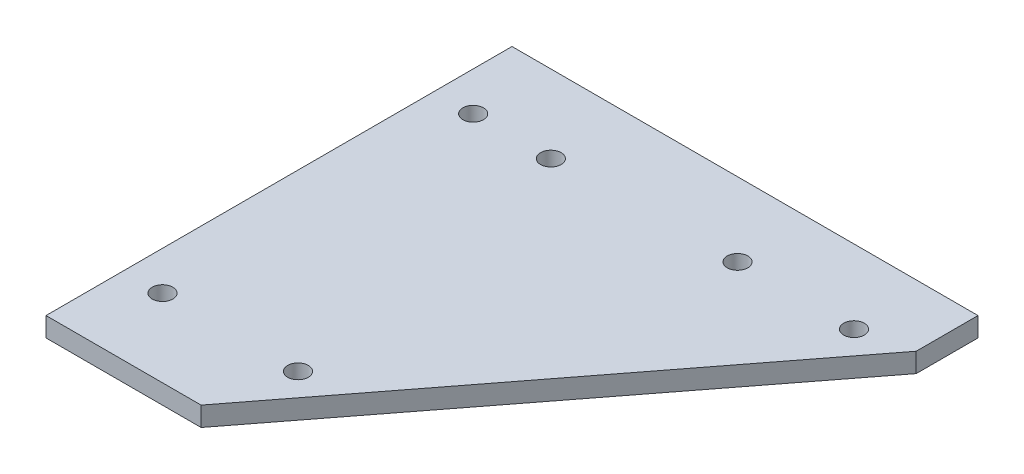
ISO-10303-21;
HEADER;
FILE_DESCRIPTION(('STEP AP214'),'2;1');
FILE_NAME('part.step','',(''),(''),'','','');
FILE_SCHEMA(('AUTOMOTIVE_DESIGN { 1 0 10303 214 1 1 1 1 }'));
ENDSEC;
DATA;
#1=APPLICATION_CONTEXT('core data for automotive mechanical design processes');
#2=APPLICATION_PROTOCOL_DEFINITION('international standard','automotive_design',2000,#1);
#3=PRODUCT_CONTEXT('',#1,'mechanical');
#4=PRODUCT('Part','Part','',(#3));
#5=PRODUCT_RELATED_PRODUCT_CATEGORY('part','',(#4));
#6=PRODUCT_DEFINITION_FORMATION('','',#4);
#7=PRODUCT_DEFINITION_CONTEXT('part definition',#1,'design');
#8=PRODUCT_DEFINITION('design','',#6,#7);
#9=PRODUCT_DEFINITION_SHAPE('','',#8);
#10=(LENGTH_UNIT() NAMED_UNIT(*) SI_UNIT(.MILLI.,.METRE.));
#11=(NAMED_UNIT(*) PLANE_ANGLE_UNIT() SI_UNIT($,.RADIAN.));
#12=(NAMED_UNIT(*) SI_UNIT($,.STERADIAN.) SOLID_ANGLE_UNIT());
#13=UNCERTAINTY_MEASURE_WITH_UNIT(LENGTH_MEASURE(1.E-05),#10,'distance_accuracy_value','');
#14=(GEOMETRIC_REPRESENTATION_CONTEXT(3) GLOBAL_UNCERTAINTY_ASSIGNED_CONTEXT((#13)) GLOBAL_UNIT_ASSIGNED_CONTEXT((#10,
#11,#12)) REPRESENTATION_CONTEXT('',''));
#15=CARTESIAN_POINT('',(0.,0.,0.));
#16=DIRECTION('',(0.,0.,1.));
#17=DIRECTION('',(1.,0.,0.));
#18=AXIS2_PLACEMENT_3D('',#15,#16,#17);
#19=CARTESIAN_POINT('',(0.,6.34999999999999,0.));
#20=DIRECTION('',(1.,0.,0.));
#21=DIRECTION('',(0.,0.,-1.));
#22=AXIS2_PLACEMENT_3D('',#19,#20,#21);
#23=PLANE('',#22);
#24=DIRECTION('',(0.,0.,1.));
#25=VECTOR('',#24,1.);
#26=CARTESIAN_POINT('',(0.,0.,0.));
#27=LINE('',#26,#25);
#28=CARTESIAN_POINT('',(0.,0.,-152.4));
#29=VERTEX_POINT('',#28);
#30=CARTESIAN_POINT('',(0.,0.,0.));
#31=VERTEX_POINT('',#30);
#32=EDGE_CURVE('E105',#29,#31,#27,.T.);
#33=ORIENTED_EDGE('',*,*,#32,.T.);
#34=DIRECTION('',(0.,-1.,0.));
#35=VECTOR('',#34,1.);
#36=CARTESIAN_POINT('',(0.,6.34999999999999,0.));
#37=LINE('',#36,#35);
#38=CARTESIAN_POINT('',(0.,6.34999999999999,0.));
#39=VERTEX_POINT('',#38);
#40=EDGE_CURVE('E11',#39,#31,#37,.T.);
#41=ORIENTED_EDGE('',*,*,#40,.F.);
#42=DIRECTION('',(0.,0.,1.));
#43=VECTOR('',#42,1.);
#44=CARTESIAN_POINT('',(0.,6.34999999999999,0.));
#45=LINE('',#44,#43);
#46=CARTESIAN_POINT('',(0.,6.34999999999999,-152.4));
#47=VERTEX_POINT('',#46);
#48=EDGE_CURVE('E96',#47,#39,#45,.T.);
#49=ORIENTED_EDGE('',*,*,#48,.F.);
#50=DIRECTION('',(0.,-1.,0.));
#51=VECTOR('',#50,1.);
#52=CARTESIAN_POINT('',(0.,6.34999999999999,-152.4));
#53=LINE('',#52,#51);
#54=EDGE_CURVE('E104',#47,#29,#53,.T.);
#55=ORIENTED_EDGE('',*,*,#54,.T.);
#56=EDGE_LOOP('',(#33,#41,#49,#55));
#57=FACE_BOUND('',#56,.T.);
#58=ADVANCED_FACE('F30',(#57),#23,.F.);
#59=CARTESIAN_POINT('',(0.,6.34999999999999,0.));
#60=DIRECTION('',(0.,0.,-1.));
#61=DIRECTION('',(-1.,0.,0.));
#62=AXIS2_PLACEMENT_3D('',#59,#60,#61);
#63=PLANE('',#62);
#64=DIRECTION('',(1.,0.,0.));
#65=VECTOR('',#64,1.);
#66=CARTESIAN_POINT('',(0.,0.,0.));
#67=LINE('',#66,#65);
#68=CARTESIAN_POINT('',(50.7282787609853,0.,0.));
#69=VERTEX_POINT('',#68);
#70=EDGE_CURVE('E92',#31,#69,#67,.T.);
#71=ORIENTED_EDGE('',*,*,#70,.T.);
#72=DIRECTION('',(0.,-1.,0.));
#73=VECTOR('',#72,1.);
#74=CARTESIAN_POINT('',(50.7282787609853,6.34999999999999,0.));
#75=LINE('',#74,#73);
#76=CARTESIAN_POINT('',(50.7282787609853,6.34999999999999,0.));
#77=VERTEX_POINT('',#76);
#78=EDGE_CURVE('E44',#77,#69,#75,.T.);
#79=ORIENTED_EDGE('',*,*,#78,.F.);
#80=DIRECTION('',(1.,0.,0.));
#81=VECTOR('',#80,1.);
#82=CARTESIAN_POINT('',(0.,6.34999999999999,0.));
#83=LINE('',#82,#81);
#84=EDGE_CURVE('E75',#39,#77,#83,.T.);
#85=ORIENTED_EDGE('',*,*,#84,.F.);
#86=ORIENTED_EDGE('',*,*,#40,.T.);
#87=EDGE_LOOP('',(#71,#79,#85,#86));
#88=FACE_BOUND('',#87,.T.);
#89=ADVANCED_FACE('F91',(#88),#63,.F.);
#90=CARTESIAN_POINT('',(152.4,6.34999999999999,0.));
#91=DIRECTION('',(-1.,0.,0.));
#92=DIRECTION('',(0.,0.,1.));
#93=AXIS2_PLACEMENT_3D('',#90,#91,#92);
#94=PLANE('',#93);
#95=DIRECTION('',(0.,0.,-1.));
#96=VECTOR('',#95,1.);
#97=CARTESIAN_POINT('',(152.4,6.34999999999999,0.));
#98=LINE('',#97,#96);
#99=CARTESIAN_POINT('',(152.4,6.35000000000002,-132.18909443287));
#100=VERTEX_POINT('',#99);
#101=CARTESIAN_POINT('',(152.4,6.35000000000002,-152.4));
#102=VERTEX_POINT('',#101);
#103=EDGE_CURVE('E98',#100,#102,#98,.T.);
#104=ORIENTED_EDGE('',*,*,#103,.F.);
#105=DIRECTION('',(0.,-1.,0.));
#106=VECTOR('',#105,1.);
#107=CARTESIAN_POINT('',(152.4,6.35000000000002,-132.18909443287));
#108=LINE('',#107,#106);
#109=CARTESIAN_POINT('',(152.4,0.,-132.18909443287));
#110=VERTEX_POINT('',#109);
#111=EDGE_CURVE('E86',#100,#110,#108,.T.);
#112=ORIENTED_EDGE('',*,*,#111,.T.);
#113=DIRECTION('',(0.,0.,-1.));
#114=VECTOR('',#113,1.);
#115=CARTESIAN_POINT('',(152.4,0.,0.));
#116=LINE('',#115,#114);
#117=CARTESIAN_POINT('',(152.4,0.,-152.4));
#118=VERTEX_POINT('',#117);
#119=EDGE_CURVE('E109',#110,#118,#116,.T.);
#120=ORIENTED_EDGE('',*,*,#119,.T.);
#121=DIRECTION('',(0.,-1.,0.));
#122=VECTOR('',#121,1.);
#123=CARTESIAN_POINT('',(152.4,6.35000000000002,-152.4));
#124=LINE('',#123,#122);
#125=EDGE_CURVE('E37',#102,#118,#124,.T.);
#126=ORIENTED_EDGE('',*,*,#125,.F.);
#127=EDGE_LOOP('',(#104,#112,#120,#126));
#128=FACE_BOUND('',#127,.T.);
#129=ADVANCED_FACE('F124',(#128),#94,.F.);
#130=CARTESIAN_POINT('',(0.,6.34999999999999,-152.4));
#131=DIRECTION('',(0.,0.,1.));
#132=DIRECTION('',(1.,0.,0.));
#133=AXIS2_PLACEMENT_3D('',#130,#131,#132);
#134=PLANE('',#133);
#135=DIRECTION('',(-1.,0.,0.));
#136=VECTOR('',#135,1.);
#137=CARTESIAN_POINT('',(0.,0.,-152.4));
#138=LINE('',#137,#136);
#139=EDGE_CURVE('E70',#118,#29,#138,.T.);
#140=ORIENTED_EDGE('',*,*,#139,.T.);
#141=ORIENTED_EDGE('',*,*,#54,.F.);
#142=DIRECTION('',(-1.,0.,0.));
#143=VECTOR('',#142,1.);
#144=CARTESIAN_POINT('',(0.,6.34999999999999,-152.4));
#145=LINE('',#144,#143);
#146=EDGE_CURVE('E53',#102,#47,#145,.T.);
#147=ORIENTED_EDGE('',*,*,#146,.F.);
#148=ORIENTED_EDGE('',*,*,#125,.T.);
#149=EDGE_LOOP('',(#140,#141,#147,#148));
#150=FACE_BOUND('',#149,.T.);
#151=ADVANCED_FACE('F113',(#150),#134,.F.);
#152=CARTESIAN_POINT('',(0.,6.34999999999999,-152.4));
#153=DIRECTION('',(0.,-1.,0.));
#154=DIRECTION('',(0.,0.,-1.));
#155=AXIS2_PLACEMENT_3D('',#152,#153,#154);
#156=PLANE('',#155);
#157=CARTESIAN_POINT('',(12.6999999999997,6.34999999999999,-127.));
#158=DIRECTION('',(0.,-1.,0.));
#159=DIRECTION('',(0.,0.,-1.));
#160=AXIS2_PLACEMENT_3D('',#157,#158,#159);
#161=CIRCLE('',#160,3.37311999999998);
#162=CARTESIAN_POINT('',(12.6999999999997,6.34999999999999,-130.37312));
#163=VERTEX_POINT('',#162);
#164=EDGE_CURVE('E168',#163,#163,#161,.T.);
#165=ORIENTED_EDGE('',*,*,#164,.T.);
#166=EDGE_LOOP('',(#165));
#167=FACE_BOUND('',#166,.T.);
#168=CARTESIAN_POINT('',(38.1,6.34999999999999,-127.));
#169=DIRECTION('',(0.,-1.,0.));
#170=DIRECTION('',(0.,0.,-1.));
#171=AXIS2_PLACEMENT_3D('',#168,#169,#170);
#172=CIRCLE('',#171,3.37311999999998);
#173=CARTESIAN_POINT('',(38.1,6.34999999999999,-130.37312));
#174=VERTEX_POINT('',#173);
#175=EDGE_CURVE('E176',#174,#174,#172,.T.);
#176=ORIENTED_EDGE('',*,*,#175,.T.);
#177=EDGE_LOOP('',(#176));
#178=FACE_BOUND('',#177,.T.);
#179=CARTESIAN_POINT('',(97.8847858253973,6.34999999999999,-128.2738760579));
#180=DIRECTION('',(0.,-1.,0.));
#181=DIRECTION('',(0.,0.,-1.));
#182=AXIS2_PLACEMENT_3D('',#179,#180,#181);
#183=CIRCLE('',#182,3.37311999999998);
#184=CARTESIAN_POINT('',(97.8847858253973,6.34999999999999,-131.6469960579));
#185=VERTEX_POINT('',#184);
#186=EDGE_CURVE('E182',#185,#185,#183,.T.);
#187=ORIENTED_EDGE('',*,*,#186,.T.);
#188=EDGE_LOOP('',(#187));
#189=FACE_BOUND('',#188,.T.);
#190=CARTESIAN_POINT('',(135.984785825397,6.35000000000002,-128.2738760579));
#191=DIRECTION('',(0.,-1.,0.));
#192=DIRECTION('',(0.,0.,-1.));
#193=AXIS2_PLACEMENT_3D('',#190,#191,#192);
#194=CIRCLE('',#193,3.37311999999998);
#195=CARTESIAN_POINT('',(135.984785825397,6.35000000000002,-131.6469960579));
#196=VERTEX_POINT('',#195);
#197=EDGE_CURVE('E188',#196,#196,#194,.T.);
#198=ORIENTED_EDGE('',*,*,#197,.T.);
#199=EDGE_LOOP('',(#198));
#200=FACE_BOUND('',#199,.T.);
#201=CARTESIAN_POINT('',(57.0065559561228,6.34999999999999,-25.3999988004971));
#202=DIRECTION('',(0.,-1.,0.));
#203=DIRECTION('',(0.,0.,-1.));
#204=AXIS2_PLACEMENT_3D('',#201,#202,#203);
#205=CIRCLE('',#204,3.37311999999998);
#206=CARTESIAN_POINT('',(57.0065559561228,6.34999999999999,-28.7731188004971));
#207=VERTEX_POINT('',#206);
#208=EDGE_CURVE('E194',#207,#207,#205,.T.);
#209=ORIENTED_EDGE('',*,*,#208,.T.);
#210=EDGE_LOOP('',(#209));
#211=FACE_BOUND('',#210,.T.);
#212=CARTESIAN_POINT('',(12.6999999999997,6.34999999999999,-25.4000000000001));
#213=DIRECTION('',(0.,-1.,0.));
#214=DIRECTION('',(0.,0.,-1.));
#215=AXIS2_PLACEMENT_3D('',#212,#213,#214);
#216=CIRCLE('',#215,3.37311999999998);
#217=CARTESIAN_POINT('',(12.6999999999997,6.34999999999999,-28.77312));
#218=VERTEX_POINT('',#217);
#219=EDGE_CURVE('E200',#218,#218,#216,.T.);
#220=ORIENTED_EDGE('',*,*,#219,.T.);
#221=EDGE_LOOP('',(#220));
#222=FACE_BOUND('',#221,.T.);
#223=ORIENTED_EDGE('',*,*,#84,.T.);
#224=DIRECTION('',(0.609664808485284,0.,-0.792659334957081));
#225=VECTOR('',#224,1.);
#226=CARTESIAN_POINT('',(50.7282787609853,6.34999999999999,0.));
#227=LINE('',#226,#225);
#228=EDGE_CURVE('E83',#77,#100,#227,.T.);
#229=ORIENTED_EDGE('',*,*,#228,.T.);
#230=ORIENTED_EDGE('',*,*,#103,.T.);
#231=ORIENTED_EDGE('',*,*,#146,.T.);
#232=ORIENTED_EDGE('',*,*,#48,.T.);
#233=EDGE_LOOP('',(#223,#229,#230,#231,#232));
#234=FACE_BOUND('',#233,.T.);
#235=ADVANCED_FACE('F94',(#167,#178,#189,#200,#211,#222,#234),#156,.F.);
#236=CARTESIAN_POINT('',(0.,0.,-152.4));
#237=DIRECTION('',(0.,-1.,0.));
#238=DIRECTION('',(0.,0.,-1.));
#239=AXIS2_PLACEMENT_3D('',#236,#237,#238);
#240=PLANE('',#239);
#241=CARTESIAN_POINT('',(12.6999999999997,0.,-127.));
#242=DIRECTION('',(0.,-1.,0.));
#243=DIRECTION('',(0.,0.,-1.));
#244=AXIS2_PLACEMENT_3D('',#241,#242,#243);
#245=CIRCLE('',#244,3.37311999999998);
#246=CARTESIAN_POINT('',(12.6999999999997,0.,-130.37312));
#247=VERTEX_POINT('',#246);
#248=EDGE_CURVE('E171',#247,#247,#245,.T.);
#249=ORIENTED_EDGE('',*,*,#248,.F.);
#250=EDGE_LOOP('',(#249));
#251=FACE_BOUND('',#250,.T.);
#252=CARTESIAN_POINT('',(38.1,0.,-127.));
#253=DIRECTION('',(0.,-1.,0.));
#254=DIRECTION('',(0.,0.,-1.));
#255=AXIS2_PLACEMENT_3D('',#252,#253,#254);
#256=CIRCLE('',#255,3.37311999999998);
#257=CARTESIAN_POINT('',(38.1,0.,-130.37312));
#258=VERTEX_POINT('',#257);
#259=EDGE_CURVE('E173',#258,#258,#256,.T.);
#260=ORIENTED_EDGE('',*,*,#259,.F.);
#261=EDGE_LOOP('',(#260));
#262=FACE_BOUND('',#261,.T.);
#263=CARTESIAN_POINT('',(97.8847858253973,0.,-128.2738760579));
#264=DIRECTION('',(0.,-1.,0.));
#265=DIRECTION('',(0.,0.,-1.));
#266=AXIS2_PLACEMENT_3D('',#263,#264,#265);
#267=CIRCLE('',#266,3.37311999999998);
#268=CARTESIAN_POINT('',(97.8847858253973,0.,-131.6469960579));
#269=VERTEX_POINT('',#268);
#270=EDGE_CURVE('E179',#269,#269,#267,.T.);
#271=ORIENTED_EDGE('',*,*,#270,.F.);
#272=EDGE_LOOP('',(#271));
#273=FACE_BOUND('',#272,.T.);
#274=CARTESIAN_POINT('',(135.984785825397,0.,-128.2738760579));
#275=DIRECTION('',(0.,-1.,0.));
#276=DIRECTION('',(0.,0.,-1.));
#277=AXIS2_PLACEMENT_3D('',#274,#275,#276);
#278=CIRCLE('',#277,3.37311999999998);
#279=CARTESIAN_POINT('',(135.984785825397,0.,-131.6469960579));
#280=VERTEX_POINT('',#279);
#281=EDGE_CURVE('E185',#280,#280,#278,.T.);
#282=ORIENTED_EDGE('',*,*,#281,.F.);
#283=EDGE_LOOP('',(#282));
#284=FACE_BOUND('',#283,.T.);
#285=CARTESIAN_POINT('',(57.0065559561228,0.,-25.3999988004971));
#286=DIRECTION('',(0.,-1.,0.));
#287=DIRECTION('',(0.,0.,-1.));
#288=AXIS2_PLACEMENT_3D('',#285,#286,#287);
#289=CIRCLE('',#288,3.37311999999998);
#290=CARTESIAN_POINT('',(57.0065559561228,0.,-28.7731188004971));
#291=VERTEX_POINT('',#290);
#292=EDGE_CURVE('E191',#291,#291,#289,.T.);
#293=ORIENTED_EDGE('',*,*,#292,.F.);
#294=EDGE_LOOP('',(#293));
#295=FACE_BOUND('',#294,.T.);
#296=CARTESIAN_POINT('',(12.6999999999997,0.,-25.4000000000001));
#297=DIRECTION('',(0.,-1.,0.));
#298=DIRECTION('',(0.,0.,-1.));
#299=AXIS2_PLACEMENT_3D('',#296,#297,#298);
#300=CIRCLE('',#299,3.37311999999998);
#301=CARTESIAN_POINT('',(12.6999999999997,0.,-28.77312));
#302=VERTEX_POINT('',#301);
#303=EDGE_CURVE('E197',#302,#302,#300,.T.);
#304=ORIENTED_EDGE('',*,*,#303,.F.);
#305=EDGE_LOOP('',(#304));
#306=FACE_BOUND('',#305,.T.);
#307=DIRECTION('',(0.609664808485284,0.,-0.792659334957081));
#308=VECTOR('',#307,1.);
#309=CARTESIAN_POINT('',(50.7282787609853,0.,0.));
#310=LINE('',#309,#308);
#311=EDGE_CURVE('E88',#69,#110,#310,.T.);
#312=ORIENTED_EDGE('',*,*,#311,.F.);
#313=ORIENTED_EDGE('',*,*,#70,.F.);
#314=ORIENTED_EDGE('',*,*,#32,.F.);
#315=ORIENTED_EDGE('',*,*,#139,.F.);
#316=ORIENTED_EDGE('',*,*,#119,.F.);
#317=EDGE_LOOP('',(#312,#313,#314,#315,#316));
#318=FACE_BOUND('',#317,.T.);
#319=ADVANCED_FACE('F118',(#251,#262,#273,#284,#295,#306,#318),#240,.T.);
#320=CARTESIAN_POINT('',(50.7282787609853,6.34999999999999,0.));
#321=DIRECTION('',(-0.792659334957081,0.,-0.609664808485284));
#322=DIRECTION('',(-0.609664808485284,0.,0.792659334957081));
#323=AXIS2_PLACEMENT_3D('',#320,#321,#322);
#324=PLANE('',#323);
#325=ORIENTED_EDGE('',*,*,#311,.T.);
#326=ORIENTED_EDGE('',*,*,#111,.F.);
#327=ORIENTED_EDGE('',*,*,#228,.F.);
#328=ORIENTED_EDGE('',*,*,#78,.T.);
#329=EDGE_LOOP('',(#325,#326,#327,#328));
#330=FACE_BOUND('',#329,.T.);
#331=ADVANCED_FACE('F84',(#330),#324,.F.);
#332=CARTESIAN_POINT('',(12.6999999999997,6.34999999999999,-25.4000000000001));
#333=DIRECTION('',(0.,-1.,0.));
#334=DIRECTION('',(0.,0.,-1.));
#335=AXIS2_PLACEMENT_3D('',#332,#333,#334);
#336=CYLINDRICAL_SURFACE('',#335,3.37311999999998);
#337=CARTESIAN_POINT('',(12.6999999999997,6.34999999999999,-28.77312));
#338=CARTESIAN_POINT('',(12.6999999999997,6.28385416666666,-28.77312));
#339=CARTESIAN_POINT('',(12.6999999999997,6.21770833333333,-28.77312));
#340=CARTESIAN_POINT('',(12.6999999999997,6.08541666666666,-28.77312));
#341=CARTESIAN_POINT('',(12.6999999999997,6.01927083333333,-28.77312));
#342=CARTESIAN_POINT('',(12.6999999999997,5.88697916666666,-28.77312));
#343=CARTESIAN_POINT('',(12.6999999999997,5.82083333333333,-28.77312));
#344=CARTESIAN_POINT('',(12.6999999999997,5.68854166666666,-28.77312));
#345=CARTESIAN_POINT('',(12.6999999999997,5.62239583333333,-28.77312));
#346=CARTESIAN_POINT('',(12.6999999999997,5.49010416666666,-28.77312));
#347=CARTESIAN_POINT('',(12.6999999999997,5.42395833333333,-28.77312));
#348=CARTESIAN_POINT('',(12.6999999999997,5.29166666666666,-28.77312));
#349=CARTESIAN_POINT('',(12.6999999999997,5.22552083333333,-28.77312));
#350=CARTESIAN_POINT('',(12.6999999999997,5.09322916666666,-28.77312));
#351=CARTESIAN_POINT('',(12.6999999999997,5.02708333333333,-28.77312));
#352=CARTESIAN_POINT('',(12.6999999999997,4.89479166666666,-28.77312));
#353=CARTESIAN_POINT('',(12.6999999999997,4.82864583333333,-28.77312));
#354=CARTESIAN_POINT('',(12.6999999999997,4.69635416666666,-28.77312));
#355=CARTESIAN_POINT('',(12.6999999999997,4.63020833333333,-28.77312));
#356=CARTESIAN_POINT('',(12.6999999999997,4.49791666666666,-28.77312));
#357=CARTESIAN_POINT('',(12.6999999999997,4.43177083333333,-28.77312));
#358=CARTESIAN_POINT('',(12.6999999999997,4.29947916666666,-28.77312));
#359=CARTESIAN_POINT('',(12.6999999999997,4.23333333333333,-28.77312));
#360=CARTESIAN_POINT('',(12.6999999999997,4.10104166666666,-28.77312));
#361=CARTESIAN_POINT('',(12.6999999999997,4.03489583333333,-28.77312));
#362=CARTESIAN_POINT('',(12.6999999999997,3.90260416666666,-28.77312));
#363=CARTESIAN_POINT('',(12.6999999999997,3.83645833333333,-28.77312));
#364=CARTESIAN_POINT('',(12.6999999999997,3.70416666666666,-28.77312));
#365=CARTESIAN_POINT('',(12.6999999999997,3.63802083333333,-28.77312));
#366=CARTESIAN_POINT('',(12.6999999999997,3.50572916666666,-28.77312));
#367=CARTESIAN_POINT('',(12.6999999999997,3.43958333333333,-28.77312));
#368=CARTESIAN_POINT('',(12.6999999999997,3.30729166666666,-28.77312));
#369=CARTESIAN_POINT('',(12.6999999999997,3.24114583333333,-28.77312));
#370=CARTESIAN_POINT('',(12.6999999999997,3.10885416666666,-28.77312));
#371=CARTESIAN_POINT('',(12.6999999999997,3.04270833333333,-28.77312));
#372=CARTESIAN_POINT('',(12.6999999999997,2.91041666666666,-28.77312));
#373=CARTESIAN_POINT('',(12.6999999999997,2.84427083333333,-28.77312));
#374=CARTESIAN_POINT('',(12.6999999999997,2.71197916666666,-28.77312));
#375=CARTESIAN_POINT('',(12.6999999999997,2.64583333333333,-28.77312));
#376=CARTESIAN_POINT('',(12.6999999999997,2.51354166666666,-28.77312));
#377=CARTESIAN_POINT('',(12.6999999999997,2.44739583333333,-28.77312));
#378=CARTESIAN_POINT('',(12.6999999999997,2.31510416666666,-28.77312));
#379=CARTESIAN_POINT('',(12.6999999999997,2.24895833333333,-28.77312));
#380=CARTESIAN_POINT('',(12.6999999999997,2.11666666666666,-28.77312));
#381=CARTESIAN_POINT('',(12.6999999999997,2.05052083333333,-28.77312));
#382=CARTESIAN_POINT('',(12.6999999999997,1.91822916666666,-28.77312));
#383=CARTESIAN_POINT('',(12.6999999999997,1.85208333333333,-28.77312));
#384=CARTESIAN_POINT('',(12.6999999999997,1.71979166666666,-28.77312));
#385=CARTESIAN_POINT('',(12.6999999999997,1.65364583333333,-28.77312));
#386=CARTESIAN_POINT('',(12.6999999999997,1.52135416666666,-28.77312));
#387=CARTESIAN_POINT('',(12.6999999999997,1.45520833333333,-28.77312));
#388=CARTESIAN_POINT('',(12.6999999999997,1.32291666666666,-28.77312));
#389=CARTESIAN_POINT('',(12.6999999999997,1.25677083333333,-28.77312));
#390=CARTESIAN_POINT('',(12.6999999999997,1.12447916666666,-28.77312));
#391=CARTESIAN_POINT('',(12.6999999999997,1.05833333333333,-28.77312));
#392=CARTESIAN_POINT('',(12.6999999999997,0.926041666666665,-28.77312));
#393=CARTESIAN_POINT('',(12.6999999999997,0.859895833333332,-28.77312));
#394=CARTESIAN_POINT('',(12.6999999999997,0.727604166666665,-28.77312));
#395=CARTESIAN_POINT('',(12.6999999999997,0.661458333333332,-28.77312));
#396=CARTESIAN_POINT('',(12.6999999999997,0.529166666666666,-28.77312));
#397=CARTESIAN_POINT('',(12.6999999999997,0.463020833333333,-28.77312));
#398=CARTESIAN_POINT('',(12.6999999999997,0.330729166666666,-28.77312));
#399=CARTESIAN_POINT('',(12.6999999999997,0.264583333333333,-28.77312));
#400=CARTESIAN_POINT('',(12.6999999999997,0.132291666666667,-28.77312));
#401=CARTESIAN_POINT('',(12.6999999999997,0.0661458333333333,-28.77312));
#402=CARTESIAN_POINT('',(12.6999999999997,0.,-28.77312));
#403=B_SPLINE_CURVE_WITH_KNOTS('',3,(#337,#338,#339,#340,#341,#342,#343,#344,#345,#346,#347,
#348,#349,#350,#351,#352,#353,#354,#355,#356,#357,#358,#359,#360,#361,#362,#363,#364,#365,#366,
#367,#368,#369,#370,#371,#372,#373,#374,#375,#376,#377,#378,#379,#380,#381,#382,#383,#384,#385,
#386,#387,#388,#389,#390,#391,#392,#393,#394,#395,#396,#397,#398,#399,#400,#401,#402),
.UNSPECIFIED.,.F.,.F.,(4,2,2,2,2,2,2,2,2,2,2,2,2,2,2,2,2,2,2,2,2,2,2,2,2,2,2,2,2,2,2,2,4),(0.,
0.198437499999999,0.396874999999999,0.595312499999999,0.793749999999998,0.992187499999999,
1.190625,1.3890625,1.5875,1.7859375,1.984375,2.1828125,2.38125,2.5796875,2.778125,2.9765625,
3.175,3.3734375,3.571875,3.7703125,3.96875,4.1671875,4.365625,4.5640625,4.7625,4.9609375,
5.159375,5.3578125,5.55625,5.75468749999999,5.95312499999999,6.15156249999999,6.34999999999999),.UNSPECIFIED.);
#404=EDGE_CURVE('BSEAM140',#218,#302,#403,.T.);
#405=ORIENTED_EDGE('',*,*,#219,.F.);
#406=ORIENTED_EDGE('',*,*,#303,.T.);
#407=ORIENTED_EDGE('',*,*,#404,.T.);
#408=ORIENTED_EDGE('',*,*,#404,.F.);
#409=EDGE_LOOP('',(#405,#407,#406,#408));
#410=FACE_BOUND('',#409,.T.);
#411=ADVANCED_FACE('F140',(#410),#336,.F.);
#412=CARTESIAN_POINT('',(57.0065559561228,6.34999999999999,-25.3999988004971));
#413=DIRECTION('',(0.,-1.,0.));
#414=DIRECTION('',(0.,0.,-1.));
#415=AXIS2_PLACEMENT_3D('',#412,#413,#414);
#416=CYLINDRICAL_SURFACE('',#415,3.37311999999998);
#417=CARTESIAN_POINT('',(57.0065559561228,6.34999999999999,-28.7731188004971));
#418=CARTESIAN_POINT('',(57.0065559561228,6.28385416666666,-28.7731188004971));
#419=CARTESIAN_POINT('',(57.0065559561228,6.21770833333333,-28.7731188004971));
#420=CARTESIAN_POINT('',(57.0065559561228,6.08541666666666,-28.7731188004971));
#421=CARTESIAN_POINT('',(57.0065559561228,6.01927083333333,-28.7731188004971));
#422=CARTESIAN_POINT('',(57.0065559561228,5.88697916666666,-28.7731188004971));
#423=CARTESIAN_POINT('',(57.0065559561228,5.82083333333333,-28.7731188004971));
#424=CARTESIAN_POINT('',(57.0065559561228,5.68854166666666,-28.7731188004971));
#425=CARTESIAN_POINT('',(57.0065559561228,5.62239583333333,-28.7731188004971));
#426=CARTESIAN_POINT('',(57.0065559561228,5.49010416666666,-28.7731188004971));
#427=CARTESIAN_POINT('',(57.0065559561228,5.42395833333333,-28.7731188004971));
#428=CARTESIAN_POINT('',(57.0065559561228,5.29166666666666,-28.7731188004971));
#429=CARTESIAN_POINT('',(57.0065559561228,5.22552083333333,-28.7731188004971));
#430=CARTESIAN_POINT('',(57.0065559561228,5.09322916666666,-28.7731188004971));
#431=CARTESIAN_POINT('',(57.0065559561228,5.02708333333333,-28.7731188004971));
#432=CARTESIAN_POINT('',(57.0065559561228,4.89479166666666,-28.7731188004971));
#433=CARTESIAN_POINT('',(57.0065559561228,4.82864583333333,-28.7731188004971));
#434=CARTESIAN_POINT('',(57.0065559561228,4.69635416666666,-28.7731188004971));
#435=CARTESIAN_POINT('',(57.0065559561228,4.63020833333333,-28.7731188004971));
#436=CARTESIAN_POINT('',(57.0065559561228,4.49791666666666,-28.7731188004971));
#437=CARTESIAN_POINT('',(57.0065559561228,4.43177083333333,-28.7731188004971));
#438=CARTESIAN_POINT('',(57.0065559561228,4.29947916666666,-28.7731188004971));
#439=CARTESIAN_POINT('',(57.0065559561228,4.23333333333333,-28.7731188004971));
#440=CARTESIAN_POINT('',(57.0065559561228,4.10104166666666,-28.7731188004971));
#441=CARTESIAN_POINT('',(57.0065559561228,4.03489583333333,-28.7731188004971));
#442=CARTESIAN_POINT('',(57.0065559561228,3.90260416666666,-28.7731188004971));
#443=CARTESIAN_POINT('',(57.0065559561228,3.83645833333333,-28.7731188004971));
#444=CARTESIAN_POINT('',(57.0065559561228,3.70416666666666,-28.7731188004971));
#445=CARTESIAN_POINT('',(57.0065559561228,3.63802083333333,-28.7731188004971));
#446=CARTESIAN_POINT('',(57.0065559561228,3.50572916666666,-28.7731188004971));
#447=CARTESIAN_POINT('',(57.0065559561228,3.43958333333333,-28.7731188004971));
#448=CARTESIAN_POINT('',(57.0065559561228,3.30729166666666,-28.7731188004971));
#449=CARTESIAN_POINT('',(57.0065559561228,3.24114583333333,-28.7731188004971));
#450=CARTESIAN_POINT('',(57.0065559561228,3.10885416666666,-28.7731188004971));
#451=CARTESIAN_POINT('',(57.0065559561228,3.04270833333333,-28.7731188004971));
#452=CARTESIAN_POINT('',(57.0065559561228,2.91041666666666,-28.7731188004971));
#453=CARTESIAN_POINT('',(57.0065559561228,2.84427083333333,-28.7731188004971));
#454=CARTESIAN_POINT('',(57.0065559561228,2.71197916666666,-28.7731188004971));
#455=CARTESIAN_POINT('',(57.0065559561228,2.64583333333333,-28.7731188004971));
#456=CARTESIAN_POINT('',(57.0065559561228,2.51354166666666,-28.7731188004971));
#457=CARTESIAN_POINT('',(57.0065559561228,2.44739583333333,-28.7731188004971));
#458=CARTESIAN_POINT('',(57.0065559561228,2.31510416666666,-28.7731188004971));
#459=CARTESIAN_POINT('',(57.0065559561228,2.24895833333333,-28.7731188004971));
#460=CARTESIAN_POINT('',(57.0065559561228,2.11666666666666,-28.7731188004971));
#461=CARTESIAN_POINT('',(57.0065559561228,2.05052083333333,-28.7731188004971));
#462=CARTESIAN_POINT('',(57.0065559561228,1.91822916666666,-28.7731188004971));
#463=CARTESIAN_POINT('',(57.0065559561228,1.85208333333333,-28.7731188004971));
#464=CARTESIAN_POINT('',(57.0065559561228,1.71979166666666,-28.7731188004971));
#465=CARTESIAN_POINT('',(57.0065559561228,1.65364583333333,-28.7731188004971));
#466=CARTESIAN_POINT('',(57.0065559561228,1.52135416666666,-28.7731188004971));
#467=CARTESIAN_POINT('',(57.0065559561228,1.45520833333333,-28.7731188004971));
#468=CARTESIAN_POINT('',(57.0065559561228,1.32291666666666,-28.7731188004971));
#469=CARTESIAN_POINT('',(57.0065559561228,1.25677083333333,-28.7731188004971));
#470=CARTESIAN_POINT('',(57.0065559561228,1.12447916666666,-28.7731188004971));
#471=CARTESIAN_POINT('',(57.0065559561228,1.05833333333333,-28.7731188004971));
#472=CARTESIAN_POINT('',(57.0065559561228,0.926041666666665,-28.7731188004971));
#473=CARTESIAN_POINT('',(57.0065559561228,0.859895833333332,-28.7731188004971));
#474=CARTESIAN_POINT('',(57.0065559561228,0.727604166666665,-28.7731188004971));
#475=CARTESIAN_POINT('',(57.0065559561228,0.661458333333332,-28.7731188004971));
#476=CARTESIAN_POINT('',(57.0065559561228,0.529166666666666,-28.7731188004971));
#477=CARTESIAN_POINT('',(57.0065559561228,0.463020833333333,-28.7731188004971));
#478=CARTESIAN_POINT('',(57.0065559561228,0.330729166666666,-28.7731188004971));
#479=CARTESIAN_POINT('',(57.0065559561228,0.264583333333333,-28.7731188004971));
#480=CARTESIAN_POINT('',(57.0065559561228,0.132291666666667,-28.7731188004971));
#481=CARTESIAN_POINT('',(57.0065559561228,0.0661458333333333,-28.7731188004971));
#482=CARTESIAN_POINT('',(57.0065559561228,0.,-28.7731188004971));
#483=B_SPLINE_CURVE_WITH_KNOTS('',3,(#417,#418,#419,#420,#421,#422,#423,#424,#425,#426,#427,
#428,#429,#430,#431,#432,#433,#434,#435,#436,#437,#438,#439,#440,#441,#442,#443,#444,#445,#446,
#447,#448,#449,#450,#451,#452,#453,#454,#455,#456,#457,#458,#459,#460,#461,#462,#463,#464,#465,
#466,#467,#468,#469,#470,#471,#472,#473,#474,#475,#476,#477,#478,#479,#480,#481,#482),
.UNSPECIFIED.,.F.,.F.,(4,2,2,2,2,2,2,2,2,2,2,2,2,2,2,2,2,2,2,2,2,2,2,2,2,2,2,2,2,2,2,2,4),(0.,
0.198437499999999,0.396874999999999,0.595312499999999,0.793749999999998,0.992187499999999,
1.190625,1.3890625,1.5875,1.7859375,1.984375,2.1828125,2.38125,2.5796875,2.778125,2.9765625,
3.175,3.3734375,3.571875,3.7703125,3.96875,4.1671875,4.365625,4.5640625,4.7625,4.9609375,
5.159375,5.3578125,5.55625,5.75468749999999,5.95312499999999,6.15156249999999,6.34999999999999),.UNSPECIFIED.);
#484=EDGE_CURVE('BSEAM143',#207,#291,#483,.T.);
#485=ORIENTED_EDGE('',*,*,#208,.F.);
#486=ORIENTED_EDGE('',*,*,#292,.T.);
#487=ORIENTED_EDGE('',*,*,#484,.T.);
#488=ORIENTED_EDGE('',*,*,#484,.F.);
#489=EDGE_LOOP('',(#485,#487,#486,#488));
#490=FACE_BOUND('',#489,.T.);
#491=ADVANCED_FACE('F143',(#490),#416,.F.);
#492=CARTESIAN_POINT('',(135.984785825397,6.35000000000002,-128.2738760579));
#493=DIRECTION('',(0.,-1.,0.));
#494=DIRECTION('',(0.,0.,-1.));
#495=AXIS2_PLACEMENT_3D('',#492,#493,#494);
#496=CYLINDRICAL_SURFACE('',#495,3.37311999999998);
#497=CARTESIAN_POINT('',(135.984785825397,6.35000000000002,-131.6469960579));
#498=CARTESIAN_POINT('',(135.984785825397,6.28385416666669,-131.6469960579));
#499=CARTESIAN_POINT('',(135.984785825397,6.21770833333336,-131.6469960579));
#500=CARTESIAN_POINT('',(135.984785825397,6.08541666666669,-131.6469960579));
#501=CARTESIAN_POINT('',(135.984785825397,6.01927083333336,-131.6469960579));
#502=CARTESIAN_POINT('',(135.984785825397,5.88697916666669,-131.6469960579));
#503=CARTESIAN_POINT('',(135.984785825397,5.82083333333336,-131.6469960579));
#504=CARTESIAN_POINT('',(135.984785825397,5.68854166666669,-131.6469960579));
#505=CARTESIAN_POINT('',(135.984785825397,5.62239583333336,-131.6469960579));
#506=CARTESIAN_POINT('',(135.984785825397,5.49010416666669,-131.6469960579));
#507=CARTESIAN_POINT('',(135.984785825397,5.42395833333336,-131.6469960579));
#508=CARTESIAN_POINT('',(135.984785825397,5.29166666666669,-131.6469960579));
#509=CARTESIAN_POINT('',(135.984785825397,5.22552083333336,-131.6469960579));
#510=CARTESIAN_POINT('',(135.984785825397,5.09322916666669,-131.6469960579));
#511=CARTESIAN_POINT('',(135.984785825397,5.02708333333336,-131.6469960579));
#512=CARTESIAN_POINT('',(135.984785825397,4.89479166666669,-131.6469960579));
#513=CARTESIAN_POINT('',(135.984785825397,4.82864583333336,-131.6469960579));
#514=CARTESIAN_POINT('',(135.984785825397,4.69635416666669,-131.6469960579));
#515=CARTESIAN_POINT('',(135.984785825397,4.63020833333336,-131.6469960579));
#516=CARTESIAN_POINT('',(135.984785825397,4.49791666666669,-131.6469960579));
#517=CARTESIAN_POINT('',(135.984785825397,4.43177083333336,-131.6469960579));
#518=CARTESIAN_POINT('',(135.984785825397,4.29947916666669,-131.6469960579));
#519=CARTESIAN_POINT('',(135.984785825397,4.23333333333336,-131.6469960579));
#520=CARTESIAN_POINT('',(135.984785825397,4.10104166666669,-131.6469960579));
#521=CARTESIAN_POINT('',(135.984785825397,4.03489583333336,-131.6469960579));
#522=CARTESIAN_POINT('',(135.984785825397,3.90260416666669,-131.6469960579));
#523=CARTESIAN_POINT('',(135.984785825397,3.83645833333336,-131.6469960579));
#524=CARTESIAN_POINT('',(135.984785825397,3.70416666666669,-131.6469960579));
#525=CARTESIAN_POINT('',(135.984785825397,3.63802083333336,-131.6469960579));
#526=CARTESIAN_POINT('',(135.984785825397,3.50572916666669,-131.6469960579));
#527=CARTESIAN_POINT('',(135.984785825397,3.43958333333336,-131.6469960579));
#528=CARTESIAN_POINT('',(135.984785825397,3.30729166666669,-131.6469960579));
#529=CARTESIAN_POINT('',(135.984785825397,3.24114583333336,-131.6469960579));
#530=CARTESIAN_POINT('',(135.984785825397,3.10885416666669,-131.6469960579));
#531=CARTESIAN_POINT('',(135.984785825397,3.04270833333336,-131.6469960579));
#532=CARTESIAN_POINT('',(135.984785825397,2.91041666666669,-131.6469960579));
#533=CARTESIAN_POINT('',(135.984785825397,2.84427083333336,-131.6469960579));
#534=CARTESIAN_POINT('',(135.984785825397,2.71197916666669,-131.6469960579));
#535=CARTESIAN_POINT('',(135.984785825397,2.64583333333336,-131.6469960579));
#536=CARTESIAN_POINT('',(135.984785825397,2.51354166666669,-131.6469960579));
#537=CARTESIAN_POINT('',(135.984785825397,2.44739583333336,-131.6469960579));
#538=CARTESIAN_POINT('',(135.984785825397,2.31510416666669,-131.6469960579));
#539=CARTESIAN_POINT('',(135.984785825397,2.24895833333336,-131.6469960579));
#540=CARTESIAN_POINT('',(135.984785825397,2.11666666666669,-131.6469960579));
#541=CARTESIAN_POINT('',(135.984785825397,2.05052083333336,-131.6469960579));
#542=CARTESIAN_POINT('',(135.984785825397,1.91822916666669,-131.6469960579));
#543=CARTESIAN_POINT('',(135.984785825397,1.85208333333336,-131.6469960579));
#544=CARTESIAN_POINT('',(135.984785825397,1.71979166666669,-131.6469960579));
#545=CARTESIAN_POINT('',(135.984785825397,1.65364583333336,-131.6469960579));
#546=CARTESIAN_POINT('',(135.984785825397,1.52135416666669,-131.6469960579));
#547=CARTESIAN_POINT('',(135.984785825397,1.45520833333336,-131.6469960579));
#548=CARTESIAN_POINT('',(135.984785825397,1.32291666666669,-131.6469960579));
#549=CARTESIAN_POINT('',(135.984785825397,1.25677083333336,-131.6469960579));
#550=CARTESIAN_POINT('',(135.984785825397,1.12447916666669,-131.6469960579));
#551=CARTESIAN_POINT('',(135.984785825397,1.05833333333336,-131.6469960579));
#552=CARTESIAN_POINT('',(135.984785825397,0.926041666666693,-131.6469960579));
#553=CARTESIAN_POINT('',(135.984785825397,0.85989583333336,-131.6469960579));
#554=CARTESIAN_POINT('',(135.984785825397,0.727604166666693,-131.6469960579));
#555=CARTESIAN_POINT('',(135.984785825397,0.66145833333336,-131.6469960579));
#556=CARTESIAN_POINT('',(135.984785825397,0.529166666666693,-131.6469960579));
#557=CARTESIAN_POINT('',(135.984785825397,0.46302083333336,-131.6469960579));
#558=CARTESIAN_POINT('',(135.984785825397,0.330729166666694,-131.6469960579));
#559=CARTESIAN_POINT('',(135.984785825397,0.264583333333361,-131.6469960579));
#560=CARTESIAN_POINT('',(135.984785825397,0.132291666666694,-131.6469960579));
#561=CARTESIAN_POINT('',(135.984785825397,0.0661458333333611,-131.6469960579));
#562=CARTESIAN_POINT('',(135.984785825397,0.,-131.6469960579));
#563=B_SPLINE_CURVE_WITH_KNOTS('',3,(#497,#498,#499,#500,#501,#502,#503,#504,#505,#506,#507,
#508,#509,#510,#511,#512,#513,#514,#515,#516,#517,#518,#519,#520,#521,#522,#523,#524,#525,#526,
#527,#528,#529,#530,#531,#532,#533,#534,#535,#536,#537,#538,#539,#540,#541,#542,#543,#544,#545,
#546,#547,#548,#549,#550,#551,#552,#553,#554,#555,#556,#557,#558,#559,#560,#561,#562),
.UNSPECIFIED.,.F.,.F.,(4,2,2,2,2,2,2,2,2,2,2,2,2,2,2,2,2,2,2,2,2,2,2,2,2,2,2,2,2,2,2,2,4),(0.,
0.198437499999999,0.396874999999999,0.595312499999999,0.793749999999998,0.992187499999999,
1.190625,1.3890625,1.5875,1.7859375,1.984375,2.1828125,2.38125,2.5796875,2.778125,2.9765625,
3.175,3.3734375,3.571875,3.7703125,3.96875,4.1671875,4.365625,4.5640625,4.7625,4.9609375,
5.159375,5.3578125,5.55625,5.75468749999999,5.95312499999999,6.15156249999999,6.34999999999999),.UNSPECIFIED.);
#564=EDGE_CURVE('BSEAM147',#196,#280,#563,.T.);
#565=ORIENTED_EDGE('',*,*,#197,.F.);
#566=ORIENTED_EDGE('',*,*,#281,.T.);
#567=ORIENTED_EDGE('',*,*,#564,.T.);
#568=ORIENTED_EDGE('',*,*,#564,.F.);
#569=EDGE_LOOP('',(#565,#567,#566,#568));
#570=FACE_BOUND('',#569,.T.);
#571=ADVANCED_FACE('F147',(#570),#496,.F.);
#572=CARTESIAN_POINT('',(97.8847858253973,6.34999999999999,-128.2738760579));
#573=DIRECTION('',(0.,-1.,0.));
#574=DIRECTION('',(0.,0.,-1.));
#575=AXIS2_PLACEMENT_3D('',#572,#573,#574);
#576=CYLINDRICAL_SURFACE('',#575,3.37311999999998);
#577=CARTESIAN_POINT('',(97.8847858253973,6.34999999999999,-131.6469960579));
#578=CARTESIAN_POINT('',(97.8847858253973,6.28385416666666,-131.6469960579));
#579=CARTESIAN_POINT('',(97.8847858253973,6.21770833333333,-131.6469960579));
#580=CARTESIAN_POINT('',(97.8847858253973,6.08541666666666,-131.6469960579));
#581=CARTESIAN_POINT('',(97.8847858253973,6.01927083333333,-131.6469960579));
#582=CARTESIAN_POINT('',(97.8847858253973,5.88697916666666,-131.6469960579));
#583=CARTESIAN_POINT('',(97.8847858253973,5.82083333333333,-131.6469960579));
#584=CARTESIAN_POINT('',(97.8847858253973,5.68854166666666,-131.6469960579));
#585=CARTESIAN_POINT('',(97.8847858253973,5.62239583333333,-131.6469960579));
#586=CARTESIAN_POINT('',(97.8847858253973,5.49010416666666,-131.6469960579));
#587=CARTESIAN_POINT('',(97.8847858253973,5.42395833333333,-131.6469960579));
#588=CARTESIAN_POINT('',(97.8847858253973,5.29166666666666,-131.6469960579));
#589=CARTESIAN_POINT('',(97.8847858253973,5.22552083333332,-131.6469960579));
#590=CARTESIAN_POINT('',(97.8847858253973,5.09322916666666,-131.6469960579));
#591=CARTESIAN_POINT('',(97.8847858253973,5.02708333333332,-131.6469960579));
#592=CARTESIAN_POINT('',(97.8847858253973,4.89479166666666,-131.6469960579));
#593=CARTESIAN_POINT('',(97.8847858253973,4.82864583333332,-131.6469960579));
#594=CARTESIAN_POINT('',(97.8847858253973,4.69635416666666,-131.6469960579));
#595=CARTESIAN_POINT('',(97.8847858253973,4.63020833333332,-131.6469960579));
#596=CARTESIAN_POINT('',(97.8847858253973,4.49791666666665,-131.6469960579));
#597=CARTESIAN_POINT('',(97.8847858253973,4.43177083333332,-131.6469960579));
#598=CARTESIAN_POINT('',(97.8847858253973,4.29947916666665,-131.6469960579));
#599=CARTESIAN_POINT('',(97.8847858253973,4.23333333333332,-131.6469960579));
#600=CARTESIAN_POINT('',(97.8847858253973,4.10104166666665,-131.6469960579));
#601=CARTESIAN_POINT('',(97.8847858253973,4.03489583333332,-131.6469960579));
#602=CARTESIAN_POINT('',(97.8847858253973,3.90260416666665,-131.6469960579));
#603=CARTESIAN_POINT('',(97.8847858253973,3.83645833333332,-131.6469960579));
#604=CARTESIAN_POINT('',(97.8847858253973,3.70416666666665,-131.6469960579));
#605=CARTESIAN_POINT('',(97.8847858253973,3.63802083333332,-131.6469960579));
#606=CARTESIAN_POINT('',(97.8847858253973,3.50572916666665,-131.6469960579));
#607=CARTESIAN_POINT('',(97.8847858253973,3.43958333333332,-131.6469960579));
#608=CARTESIAN_POINT('',(97.8847858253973,3.30729166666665,-131.6469960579));
#609=CARTESIAN_POINT('',(97.8847858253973,3.24114583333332,-131.6469960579));
#610=CARTESIAN_POINT('',(97.8847858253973,3.10885416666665,-131.6469960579));
#611=CARTESIAN_POINT('',(97.8847858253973,3.04270833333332,-131.6469960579));
#612=CARTESIAN_POINT('',(97.8847858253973,2.91041666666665,-131.6469960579));
#613=CARTESIAN_POINT('',(97.8847858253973,2.84427083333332,-131.6469960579));
#614=CARTESIAN_POINT('',(97.8847858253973,2.71197916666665,-131.6469960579));
#615=CARTESIAN_POINT('',(97.8847858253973,2.64583333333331,-131.6469960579));
#616=CARTESIAN_POINT('',(97.8847858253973,2.51354166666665,-131.6469960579));
#617=CARTESIAN_POINT('',(97.8847858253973,2.44739583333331,-131.6469960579));
#618=CARTESIAN_POINT('',(97.8847858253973,2.31510416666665,-131.6469960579));
#619=CARTESIAN_POINT('',(97.8847858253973,2.24895833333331,-131.6469960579));
#620=CARTESIAN_POINT('',(97.8847858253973,2.11666666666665,-131.6469960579));
#621=CARTESIAN_POINT('',(97.8847858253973,2.05052083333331,-131.6469960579));
#622=CARTESIAN_POINT('',(97.8847858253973,1.91822916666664,-131.6469960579));
#623=CARTESIAN_POINT('',(97.8847858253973,1.85208333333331,-131.6469960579));
#624=CARTESIAN_POINT('',(97.8847858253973,1.71979166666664,-131.6469960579));
#625=CARTESIAN_POINT('',(97.8847858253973,1.65364583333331,-131.6469960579));
#626=CARTESIAN_POINT('',(97.8847858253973,1.52135416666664,-131.6469960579));
#627=CARTESIAN_POINT('',(97.8847858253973,1.45520833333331,-131.6469960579));
#628=CARTESIAN_POINT('',(97.8847858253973,1.32291666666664,-131.6469960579));
#629=CARTESIAN_POINT('',(97.8847858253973,1.25677083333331,-131.6469960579));
#630=CARTESIAN_POINT('',(97.8847858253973,1.12447916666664,-131.6469960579));
#631=CARTESIAN_POINT('',(97.8847858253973,1.05833333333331,-131.6469960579));
#632=CARTESIAN_POINT('',(97.8847858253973,0.926041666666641,-131.6469960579));
#633=CARTESIAN_POINT('',(97.8847858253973,0.859895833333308,-131.6469960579));
#634=CARTESIAN_POINT('',(97.8847858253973,0.727604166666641,-131.6469960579));
#635=CARTESIAN_POINT('',(97.8847858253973,0.661458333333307,-131.6469960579));
#636=CARTESIAN_POINT('',(97.8847858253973,0.52916666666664,-131.6469960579));
#637=CARTESIAN_POINT('',(97.8847858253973,0.463020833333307,-131.6469960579));
#638=CARTESIAN_POINT('',(97.8847858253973,0.33072916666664,-131.6469960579));
#639=CARTESIAN_POINT('',(97.8847858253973,0.264583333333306,-131.6469960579));
#640=CARTESIAN_POINT('',(97.8847858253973,0.132291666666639,-131.6469960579));
#641=CARTESIAN_POINT('',(97.8847858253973,0.0661458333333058,-131.6469960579));
#642=CARTESIAN_POINT('',(97.8847858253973,0.,-131.6469960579));
#643=B_SPLINE_CURVE_WITH_KNOTS('',3,(#577,#578,#579,#580,#581,#582,#583,#584,#585,#586,#587,
#588,#589,#590,#591,#592,#593,#594,#595,#596,#597,#598,#599,#600,#601,#602,#603,#604,#605,#606,
#607,#608,#609,#610,#611,#612,#613,#614,#615,#616,#617,#618,#619,#620,#621,#622,#623,#624,#625,
#626,#627,#628,#629,#630,#631,#632,#633,#634,#635,#636,#637,#638,#639,#640,#641,#642),
.UNSPECIFIED.,.F.,.F.,(4,2,2,2,2,2,2,2,2,2,2,2,2,2,2,2,2,2,2,2,2,2,2,2,2,2,2,2,2,2,2,2,4),(0.,
0.1984375,0.396875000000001,0.595312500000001,0.793750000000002,0.992187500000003,1.190625,
1.3890625,1.5875,1.78593750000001,1.98437500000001,2.18281250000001,2.38125000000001,
2.57968750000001,2.77812500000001,2.97656250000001,3.17500000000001,3.37343750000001,
3.57187500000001,3.77031250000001,3.96875000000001,4.16718750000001,4.36562500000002,
4.56406250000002,4.76250000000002,4.96093750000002,5.15937500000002,5.35781250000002,
5.55625000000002,5.75468750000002,5.95312500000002,6.15156250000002,6.35000000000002),.UNSPECIFIED.);
#644=EDGE_CURVE('BSEAM151',#185,#269,#643,.T.);
#645=ORIENTED_EDGE('',*,*,#186,.F.);
#646=ORIENTED_EDGE('',*,*,#270,.T.);
#647=ORIENTED_EDGE('',*,*,#644,.T.);
#648=ORIENTED_EDGE('',*,*,#644,.F.);
#649=EDGE_LOOP('',(#645,#647,#646,#648));
#650=FACE_BOUND('',#649,.T.);
#651=ADVANCED_FACE('F151',(#650),#576,.F.);
#652=CARTESIAN_POINT('',(38.1,6.34999999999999,-127.));
#653=DIRECTION('',(0.,-1.,0.));
#654=DIRECTION('',(0.,0.,-1.));
#655=AXIS2_PLACEMENT_3D('',#652,#653,#654);
#656=CYLINDRICAL_SURFACE('',#655,3.37311999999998);
#657=CARTESIAN_POINT('',(38.1,6.34999999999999,-130.37312));
#658=CARTESIAN_POINT('',(38.1,6.28385416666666,-130.37312));
#659=CARTESIAN_POINT('',(38.1,6.21770833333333,-130.37312));
#660=CARTESIAN_POINT('',(38.1,6.08541666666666,-130.37312));
#661=CARTESIAN_POINT('',(38.1,6.01927083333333,-130.37312));
#662=CARTESIAN_POINT('',(38.1,5.88697916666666,-130.37312));
#663=CARTESIAN_POINT('',(38.1,5.82083333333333,-130.37312));
#664=CARTESIAN_POINT('',(38.1,5.68854166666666,-130.37312));
#665=CARTESIAN_POINT('',(38.1,5.62239583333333,-130.37312));
#666=CARTESIAN_POINT('',(38.1,5.49010416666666,-130.37312));
#667=CARTESIAN_POINT('',(38.1,5.42395833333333,-130.37312));
#668=CARTESIAN_POINT('',(38.1,5.29166666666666,-130.37312));
#669=CARTESIAN_POINT('',(38.1,5.22552083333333,-130.37312));
#670=CARTESIAN_POINT('',(38.1,5.09322916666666,-130.37312));
#671=CARTESIAN_POINT('',(38.1,5.02708333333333,-130.37312));
#672=CARTESIAN_POINT('',(38.1,4.89479166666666,-130.37312));
#673=CARTESIAN_POINT('',(38.1,4.82864583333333,-130.37312));
#674=CARTESIAN_POINT('',(38.1,4.69635416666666,-130.37312));
#675=CARTESIAN_POINT('',(38.1,4.63020833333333,-130.37312));
#676=CARTESIAN_POINT('',(38.1,4.49791666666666,-130.37312));
#677=CARTESIAN_POINT('',(38.1,4.43177083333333,-130.37312));
#678=CARTESIAN_POINT('',(38.1,4.29947916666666,-130.37312));
#679=CARTESIAN_POINT('',(38.1,4.23333333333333,-130.37312));
#680=CARTESIAN_POINT('',(38.1,4.10104166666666,-130.37312));
#681=CARTESIAN_POINT('',(38.1,4.03489583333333,-130.37312));
#682=CARTESIAN_POINT('',(38.1,3.90260416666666,-130.37312));
#683=CARTESIAN_POINT('',(38.1,3.83645833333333,-130.37312));
#684=CARTESIAN_POINT('',(38.1,3.70416666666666,-130.37312));
#685=CARTESIAN_POINT('',(38.1,3.63802083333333,-130.37312));
#686=CARTESIAN_POINT('',(38.1,3.50572916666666,-130.37312));
#687=CARTESIAN_POINT('',(38.1,3.43958333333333,-130.37312));
#688=CARTESIAN_POINT('',(38.1,3.30729166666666,-130.37312));
#689=CARTESIAN_POINT('',(38.1,3.24114583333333,-130.37312));
#690=CARTESIAN_POINT('',(38.1,3.10885416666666,-130.37312));
#691=CARTESIAN_POINT('',(38.1,3.04270833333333,-130.37312));
#692=CARTESIAN_POINT('',(38.1,2.91041666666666,-130.37312));
#693=CARTESIAN_POINT('',(38.1,2.84427083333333,-130.37312));
#694=CARTESIAN_POINT('',(38.1,2.71197916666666,-130.37312));
#695=CARTESIAN_POINT('',(38.1,2.64583333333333,-130.37312));
#696=CARTESIAN_POINT('',(38.1,2.51354166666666,-130.37312));
#697=CARTESIAN_POINT('',(38.1,2.44739583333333,-130.37312));
#698=CARTESIAN_POINT('',(38.1,2.31510416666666,-130.37312));
#699=CARTESIAN_POINT('',(38.1,2.24895833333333,-130.37312));
#700=CARTESIAN_POINT('',(38.1,2.11666666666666,-130.37312));
#701=CARTESIAN_POINT('',(38.1,2.05052083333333,-130.37312));
#702=CARTESIAN_POINT('',(38.1,1.91822916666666,-130.37312));
#703=CARTESIAN_POINT('',(38.1,1.85208333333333,-130.37312));
#704=CARTESIAN_POINT('',(38.1,1.71979166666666,-130.37312));
#705=CARTESIAN_POINT('',(38.1,1.65364583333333,-130.37312));
#706=CARTESIAN_POINT('',(38.1,1.52135416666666,-130.37312));
#707=CARTESIAN_POINT('',(38.1,1.45520833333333,-130.37312));
#708=CARTESIAN_POINT('',(38.1,1.32291666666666,-130.37312));
#709=CARTESIAN_POINT('',(38.1,1.25677083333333,-130.37312));
#710=CARTESIAN_POINT('',(38.1,1.12447916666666,-130.37312));
#711=CARTESIAN_POINT('',(38.1,1.05833333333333,-130.37312));
#712=CARTESIAN_POINT('',(38.1,0.926041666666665,-130.37312));
#713=CARTESIAN_POINT('',(38.1,0.859895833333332,-130.37312));
#714=CARTESIAN_POINT('',(38.1,0.727604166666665,-130.37312));
#715=CARTESIAN_POINT('',(38.1,0.661458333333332,-130.37312));
#716=CARTESIAN_POINT('',(38.1,0.529166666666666,-130.37312));
#717=CARTESIAN_POINT('',(38.1,0.463020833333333,-130.37312));
#718=CARTESIAN_POINT('',(38.1,0.330729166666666,-130.37312));
#719=CARTESIAN_POINT('',(38.1,0.264583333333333,-130.37312));
#720=CARTESIAN_POINT('',(38.1,0.132291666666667,-130.37312));
#721=CARTESIAN_POINT('',(38.1,0.0661458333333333,-130.37312));
#722=CARTESIAN_POINT('',(38.1,0.,-130.37312));
#723=B_SPLINE_CURVE_WITH_KNOTS('',3,(#657,#658,#659,#660,#661,#662,#663,#664,#665,#666,#667,
#668,#669,#670,#671,#672,#673,#674,#675,#676,#677,#678,#679,#680,#681,#682,#683,#684,#685,#686,
#687,#688,#689,#690,#691,#692,#693,#694,#695,#696,#697,#698,#699,#700,#701,#702,#703,#704,#705,
#706,#707,#708,#709,#710,#711,#712,#713,#714,#715,#716,#717,#718,#719,#720,#721,#722),
.UNSPECIFIED.,.F.,.F.,(4,2,2,2,2,2,2,2,2,2,2,2,2,2,2,2,2,2,2,2,2,2,2,2,2,2,2,2,2,2,2,2,4),(0.,
0.198437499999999,0.396874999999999,0.595312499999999,0.793749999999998,0.992187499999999,
1.190625,1.3890625,1.5875,1.7859375,1.984375,2.1828125,2.38125,2.5796875,2.778125,2.9765625,
3.175,3.3734375,3.571875,3.7703125,3.96875,4.1671875,4.365625,4.5640625,4.7625,4.9609375,
5.159375,5.3578125,5.55625,5.75468749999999,5.95312499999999,6.15156249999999,6.34999999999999),.UNSPECIFIED.);
#724=EDGE_CURVE('BSEAM155',#174,#258,#723,.T.);
#725=ORIENTED_EDGE('',*,*,#175,.F.);
#726=ORIENTED_EDGE('',*,*,#259,.T.);
#727=ORIENTED_EDGE('',*,*,#724,.T.);
#728=ORIENTED_EDGE('',*,*,#724,.F.);
#729=EDGE_LOOP('',(#725,#727,#726,#728));
#730=FACE_BOUND('',#729,.T.);
#731=ADVANCED_FACE('F155',(#730),#656,.F.);
#732=CARTESIAN_POINT('',(12.6999999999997,6.34999999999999,-127.));
#733=DIRECTION('',(0.,-1.,0.));
#734=DIRECTION('',(0.,0.,-1.));
#735=AXIS2_PLACEMENT_3D('',#732,#733,#734);
#736=CYLINDRICAL_SURFACE('',#735,3.37311999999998);
#737=CARTESIAN_POINT('',(12.6999999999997,6.34999999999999,-130.37312));
#738=CARTESIAN_POINT('',(12.6999999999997,6.28385416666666,-130.37312));
#739=CARTESIAN_POINT('',(12.6999999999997,6.21770833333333,-130.37312));
#740=CARTESIAN_POINT('',(12.6999999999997,6.08541666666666,-130.37312));
#741=CARTESIAN_POINT('',(12.6999999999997,6.01927083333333,-130.37312));
#742=CARTESIAN_POINT('',(12.6999999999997,5.88697916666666,-130.37312));
#743=CARTESIAN_POINT('',(12.6999999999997,5.82083333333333,-130.37312));
#744=CARTESIAN_POINT('',(12.6999999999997,5.68854166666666,-130.37312));
#745=CARTESIAN_POINT('',(12.6999999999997,5.62239583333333,-130.37312));
#746=CARTESIAN_POINT('',(12.6999999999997,5.49010416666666,-130.37312));
#747=CARTESIAN_POINT('',(12.6999999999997,5.42395833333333,-130.37312));
#748=CARTESIAN_POINT('',(12.6999999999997,5.29166666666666,-130.37312));
#749=CARTESIAN_POINT('',(12.6999999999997,5.22552083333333,-130.37312));
#750=CARTESIAN_POINT('',(12.6999999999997,5.09322916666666,-130.37312));
#751=CARTESIAN_POINT('',(12.6999999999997,5.02708333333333,-130.37312));
#752=CARTESIAN_POINT('',(12.6999999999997,4.89479166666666,-130.37312));
#753=CARTESIAN_POINT('',(12.6999999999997,4.82864583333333,-130.37312));
#754=CARTESIAN_POINT('',(12.6999999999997,4.69635416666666,-130.37312));
#755=CARTESIAN_POINT('',(12.6999999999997,4.63020833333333,-130.37312));
#756=CARTESIAN_POINT('',(12.6999999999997,4.49791666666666,-130.37312));
#757=CARTESIAN_POINT('',(12.6999999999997,4.43177083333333,-130.37312));
#758=CARTESIAN_POINT('',(12.6999999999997,4.29947916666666,-130.37312));
#759=CARTESIAN_POINT('',(12.6999999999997,4.23333333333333,-130.37312));
#760=CARTESIAN_POINT('',(12.6999999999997,4.10104166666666,-130.37312));
#761=CARTESIAN_POINT('',(12.6999999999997,4.03489583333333,-130.37312));
#762=CARTESIAN_POINT('',(12.6999999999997,3.90260416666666,-130.37312));
#763=CARTESIAN_POINT('',(12.6999999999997,3.83645833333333,-130.37312));
#764=CARTESIAN_POINT('',(12.6999999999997,3.70416666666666,-130.37312));
#765=CARTESIAN_POINT('',(12.6999999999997,3.63802083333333,-130.37312));
#766=CARTESIAN_POINT('',(12.6999999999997,3.50572916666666,-130.37312));
#767=CARTESIAN_POINT('',(12.6999999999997,3.43958333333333,-130.37312));
#768=CARTESIAN_POINT('',(12.6999999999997,3.30729166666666,-130.37312));
#769=CARTESIAN_POINT('',(12.6999999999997,3.24114583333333,-130.37312));
#770=CARTESIAN_POINT('',(12.6999999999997,3.10885416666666,-130.37312));
#771=CARTESIAN_POINT('',(12.6999999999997,3.04270833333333,-130.37312));
#772=CARTESIAN_POINT('',(12.6999999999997,2.91041666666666,-130.37312));
#773=CARTESIAN_POINT('',(12.6999999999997,2.84427083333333,-130.37312));
#774=CARTESIAN_POINT('',(12.6999999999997,2.71197916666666,-130.37312));
#775=CARTESIAN_POINT('',(12.6999999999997,2.64583333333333,-130.37312));
#776=CARTESIAN_POINT('',(12.6999999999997,2.51354166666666,-130.37312));
#777=CARTESIAN_POINT('',(12.6999999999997,2.44739583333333,-130.37312));
#778=CARTESIAN_POINT('',(12.6999999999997,2.31510416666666,-130.37312));
#779=CARTESIAN_POINT('',(12.6999999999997,2.24895833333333,-130.37312));
#780=CARTESIAN_POINT('',(12.6999999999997,2.11666666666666,-130.37312));
#781=CARTESIAN_POINT('',(12.6999999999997,2.05052083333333,-130.37312));
#782=CARTESIAN_POINT('',(12.6999999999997,1.91822916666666,-130.37312));
#783=CARTESIAN_POINT('',(12.6999999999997,1.85208333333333,-130.37312));
#784=CARTESIAN_POINT('',(12.6999999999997,1.71979166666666,-130.37312));
#785=CARTESIAN_POINT('',(12.6999999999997,1.65364583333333,-130.37312));
#786=CARTESIAN_POINT('',(12.6999999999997,1.52135416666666,-130.37312));
#787=CARTESIAN_POINT('',(12.6999999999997,1.45520833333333,-130.37312));
#788=CARTESIAN_POINT('',(12.6999999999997,1.32291666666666,-130.37312));
#789=CARTESIAN_POINT('',(12.6999999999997,1.25677083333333,-130.37312));
#790=CARTESIAN_POINT('',(12.6999999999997,1.12447916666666,-130.37312));
#791=CARTESIAN_POINT('',(12.6999999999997,1.05833333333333,-130.37312));
#792=CARTESIAN_POINT('',(12.6999999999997,0.926041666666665,-130.37312));
#793=CARTESIAN_POINT('',(12.6999999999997,0.859895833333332,-130.37312));
#794=CARTESIAN_POINT('',(12.6999999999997,0.727604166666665,-130.37312));
#795=CARTESIAN_POINT('',(12.6999999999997,0.661458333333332,-130.37312));
#796=CARTESIAN_POINT('',(12.6999999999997,0.529166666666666,-130.37312));
#797=CARTESIAN_POINT('',(12.6999999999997,0.463020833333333,-130.37312));
#798=CARTESIAN_POINT('',(12.6999999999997,0.330729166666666,-130.37312));
#799=CARTESIAN_POINT('',(12.6999999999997,0.264583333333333,-130.37312));
#800=CARTESIAN_POINT('',(12.6999999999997,0.132291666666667,-130.37312));
#801=CARTESIAN_POINT('',(12.6999999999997,0.0661458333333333,-130.37312));
#802=CARTESIAN_POINT('',(12.6999999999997,0.,-130.37312));
#803=B_SPLINE_CURVE_WITH_KNOTS('',3,(#737,#738,#739,#740,#741,#742,#743,#744,#745,#746,#747,
#748,#749,#750,#751,#752,#753,#754,#755,#756,#757,#758,#759,#760,#761,#762,#763,#764,#765,#766,
#767,#768,#769,#770,#771,#772,#773,#774,#775,#776,#777,#778,#779,#780,#781,#782,#783,#784,#785,
#786,#787,#788,#789,#790,#791,#792,#793,#794,#795,#796,#797,#798,#799,#800,#801,#802),
.UNSPECIFIED.,.F.,.F.,(4,2,2,2,2,2,2,2,2,2,2,2,2,2,2,2,2,2,2,2,2,2,2,2,2,2,2,2,2,2,2,2,4),(0.,
0.198437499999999,0.396874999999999,0.595312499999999,0.793749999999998,0.992187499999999,
1.190625,1.3890625,1.5875,1.7859375,1.984375,2.1828125,2.38125,2.5796875,2.778125,2.9765625,
3.175,3.3734375,3.571875,3.7703125,3.96875,4.1671875,4.365625,4.5640625,4.7625,4.9609375,
5.159375,5.3578125,5.55625,5.75468749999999,5.95312499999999,6.15156249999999,6.34999999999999),.UNSPECIFIED.);
#804=EDGE_CURVE('BSEAM159',#163,#247,#803,.T.);
#805=ORIENTED_EDGE('',*,*,#164,.F.);
#806=ORIENTED_EDGE('',*,*,#248,.T.);
#807=ORIENTED_EDGE('',*,*,#804,.T.);
#808=ORIENTED_EDGE('',*,*,#804,.F.);
#809=EDGE_LOOP('',(#805,#807,#806,#808));
#810=FACE_BOUND('',#809,.T.);
#811=ADVANCED_FACE('F159',(#810),#736,.F.);
#812=CLOSED_SHELL('',(#58,#89,#129,#151,#235,#319,#331,#411,#491,#571,#651,#731,#811));
#813=MANIFOLD_SOLID_BREP('B2',#812);
#814=ADVANCED_BREP_SHAPE_REPRESENTATION('',(#18,#813),#14);
#815=SHAPE_DEFINITION_REPRESENTATION(#9,#814);
ENDSEC;
END-ISO-10303-21;
